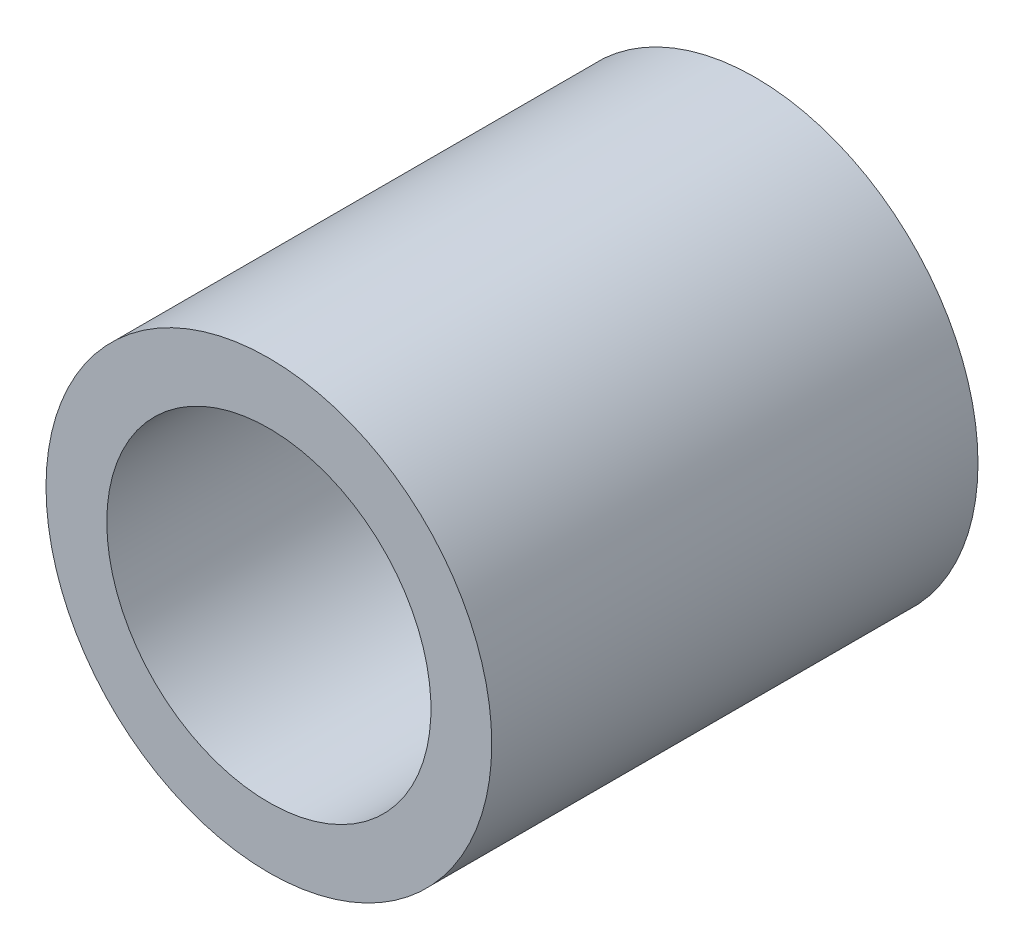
ISO-10303-21;
HEADER;
FILE_DESCRIPTION(('STEP AP214'),'2;1');
FILE_NAME('part.step','',(''),(''),'','','');
FILE_SCHEMA(('AUTOMOTIVE_DESIGN { 1 0 10303 214 1 1 1 1 }'));
ENDSEC;
DATA;
#1=APPLICATION_CONTEXT('core data for automotive mechanical design processes');
#2=APPLICATION_PROTOCOL_DEFINITION('international standard','automotive_design',2000,#1);
#3=PRODUCT_CONTEXT('',#1,'mechanical');
#4=PRODUCT('Part','Part','',(#3));
#5=PRODUCT_RELATED_PRODUCT_CATEGORY('part','',(#4));
#6=PRODUCT_DEFINITION_FORMATION('','',#4);
#7=PRODUCT_DEFINITION_CONTEXT('part definition',#1,'design');
#8=PRODUCT_DEFINITION('design','',#6,#7);
#9=PRODUCT_DEFINITION_SHAPE('','',#8);
#10=(LENGTH_UNIT() NAMED_UNIT(*) SI_UNIT(.MILLI.,.METRE.));
#11=(NAMED_UNIT(*) PLANE_ANGLE_UNIT() SI_UNIT($,.RADIAN.));
#12=(NAMED_UNIT(*) SI_UNIT($,.STERADIAN.) SOLID_ANGLE_UNIT());
#13=UNCERTAINTY_MEASURE_WITH_UNIT(LENGTH_MEASURE(1.E-05),#10,'distance_accuracy_value','');
#14=(GEOMETRIC_REPRESENTATION_CONTEXT(3) GLOBAL_UNCERTAINTY_ASSIGNED_CONTEXT((#13)) GLOBAL_UNIT_ASSIGNED_CONTEXT((#10,
#11,#12)) REPRESENTATION_CONTEXT('',''));
#15=CARTESIAN_POINT('',(0.,0.,0.));
#16=DIRECTION('',(0.,0.,1.));
#17=DIRECTION('',(1.,0.,0.));
#18=AXIS2_PLACEMENT_3D('',#15,#16,#17);
#19=CARTESIAN_POINT('',(0.,0.,19.05));
#20=DIRECTION('',(0.,0.,1.));
#21=DIRECTION('',(1.,0.,0.));
#22=AXIS2_PLACEMENT_3D('',#19,#20,#21);
#23=PLANE('',#22);
#24=CARTESIAN_POINT('',(0.,0.,19.05));
#25=DIRECTION('',(0.,0.,1.));
#26=DIRECTION('',(1.,0.,0.));
#27=AXIS2_PLACEMENT_3D('',#24,#25,#26);
#28=CIRCLE('',#27,8.73125);
#29=CARTESIAN_POINT('',(-8.73125,0.,19.05));
#30=VERTEX_POINT('',#29);
#31=EDGE_CURVE('E10',#30,#30,#28,.T.);
#32=ORIENTED_EDGE('',*,*,#31,.T.);
#33=EDGE_LOOP('',(#32));
#34=FACE_BOUND('',#33,.T.);
#35=CARTESIAN_POINT('',(0.,0.,19.05));
#36=DIRECTION('',(0.,0.,1.));
#37=DIRECTION('',(1.,0.,0.));
#38=AXIS2_PLACEMENT_3D('',#35,#36,#37);
#39=CIRCLE('',#38,6.35);
#40=CARTESIAN_POINT('',(-6.35,0.,19.05));
#41=VERTEX_POINT('',#40);
#42=EDGE_CURVE('E40',#41,#41,#39,.T.);
#43=ORIENTED_EDGE('',*,*,#42,.F.);
#44=EDGE_LOOP('',(#43));
#45=FACE_BOUND('',#44,.T.);
#46=ADVANCED_FACE('F29',(#34,#45),#23,.T.);
#47=CARTESIAN_POINT('',(0.,0.,0.));
#48=DIRECTION('',(0.,0.,1.));
#49=DIRECTION('',(1.,0.,0.));
#50=AXIS2_PLACEMENT_3D('',#47,#48,#49);
#51=PLANE('',#50);
#52=CARTESIAN_POINT('',(0.,0.,0.));
#53=DIRECTION('',(0.,0.,1.));
#54=DIRECTION('',(1.,0.,0.));
#55=AXIS2_PLACEMENT_3D('',#52,#53,#54);
#56=CIRCLE('',#55,8.73125);
#57=CARTESIAN_POINT('',(-8.73125,0.,0.));
#58=VERTEX_POINT('',#57);
#59=EDGE_CURVE('E36',#58,#58,#56,.T.);
#60=ORIENTED_EDGE('',*,*,#59,.F.);
#61=EDGE_LOOP('',(#60));
#62=FACE_BOUND('',#61,.T.);
#63=CARTESIAN_POINT('',(0.,0.,0.));
#64=DIRECTION('',(0.,0.,1.));
#65=DIRECTION('',(1.,0.,0.));
#66=AXIS2_PLACEMENT_3D('',#63,#64,#65);
#67=CIRCLE('',#66,6.35);
#68=CARTESIAN_POINT('',(-6.35,0.,0.));
#69=VERTEX_POINT('',#68);
#70=EDGE_CURVE('E44',#69,#69,#67,.T.);
#71=ORIENTED_EDGE('',*,*,#70,.T.);
#72=EDGE_LOOP('',(#71));
#73=FACE_BOUND('',#72,.T.);
#74=ADVANCED_FACE('F50',(#62,#73),#51,.F.);
#75=CARTESIAN_POINT('',(0.,0.,19.05));
#76=DIRECTION('',(0.,0.,-1.));
#77=DIRECTION('',(-1.,0.,0.));
#78=AXIS2_PLACEMENT_3D('',#75,#76,#77);
#79=CYLINDRICAL_SURFACE('',#78,8.73125);
#80=CARTESIAN_POINT('',(-8.73125,0.,19.05));
#81=CARTESIAN_POINT('',(-8.73125,0.,18.8515625));
#82=CARTESIAN_POINT('',(-8.73125,0.,18.653125));
#83=CARTESIAN_POINT('',(-8.73125,0.,18.25625));
#84=CARTESIAN_POINT('',(-8.73125,0.,18.0578125));
#85=CARTESIAN_POINT('',(-8.73125,0.,17.6609375));
#86=CARTESIAN_POINT('',(-8.73125,0.,17.4625));
#87=CARTESIAN_POINT('',(-8.73125,0.,17.065625));
#88=CARTESIAN_POINT('',(-8.73125,0.,16.8671875));
#89=CARTESIAN_POINT('',(-8.73125,0.,16.4703125));
#90=CARTESIAN_POINT('',(-8.73125,0.,16.271875));
#91=CARTESIAN_POINT('',(-8.73125,0.,15.875));
#92=CARTESIAN_POINT('',(-8.73125,0.,15.6765625));
#93=CARTESIAN_POINT('',(-8.73125,0.,15.2796875));
#94=CARTESIAN_POINT('',(-8.73125,0.,15.08125));
#95=CARTESIAN_POINT('',(-8.73125,0.,14.684375));
#96=CARTESIAN_POINT('',(-8.73125,0.,14.4859375));
#97=CARTESIAN_POINT('',(-8.73125,0.,14.0890625));
#98=CARTESIAN_POINT('',(-8.73125,0.,13.890625));
#99=CARTESIAN_POINT('',(-8.73125,0.,13.49375));
#100=CARTESIAN_POINT('',(-8.73125,0.,13.2953125));
#101=CARTESIAN_POINT('',(-8.73125,0.,12.8984375));
#102=CARTESIAN_POINT('',(-8.73125,0.,12.7));
#103=CARTESIAN_POINT('',(-8.73125,0.,12.303125));
#104=CARTESIAN_POINT('',(-8.73125,0.,12.1046875));
#105=CARTESIAN_POINT('',(-8.73125,0.,11.7078125));
#106=CARTESIAN_POINT('',(-8.73125,0.,11.509375));
#107=CARTESIAN_POINT('',(-8.73125,0.,11.1125));
#108=CARTESIAN_POINT('',(-8.73125,0.,10.9140625));
#109=CARTESIAN_POINT('',(-8.73125,0.,10.5171875));
#110=CARTESIAN_POINT('',(-8.73125,0.,10.31875));
#111=CARTESIAN_POINT('',(-8.73125,0.,9.921875));
#112=CARTESIAN_POINT('',(-8.73125,0.,9.7234375));
#113=CARTESIAN_POINT('',(-8.73125,0.,9.3265625));
#114=CARTESIAN_POINT('',(-8.73125,0.,9.128125));
#115=CARTESIAN_POINT('',(-8.73125,0.,8.73125));
#116=CARTESIAN_POINT('',(-8.73125,0.,8.5328125));
#117=CARTESIAN_POINT('',(-8.73125,0.,8.1359375));
#118=CARTESIAN_POINT('',(-8.73125,0.,7.9375));
#119=CARTESIAN_POINT('',(-8.73125,0.,7.540625));
#120=CARTESIAN_POINT('',(-8.73125,0.,7.3421875));
#121=CARTESIAN_POINT('',(-8.73125,0.,6.9453125));
#122=CARTESIAN_POINT('',(-8.73125,0.,6.746875));
#123=CARTESIAN_POINT('',(-8.73125,0.,6.35));
#124=CARTESIAN_POINT('',(-8.73125,0.,6.1515625));
#125=CARTESIAN_POINT('',(-8.73125,0.,5.7546875));
#126=CARTESIAN_POINT('',(-8.73125,0.,5.55625));
#127=CARTESIAN_POINT('',(-8.73125,0.,5.159375));
#128=CARTESIAN_POINT('',(-8.73125,0.,4.9609375));
#129=CARTESIAN_POINT('',(-8.73125,0.,4.5640625));
#130=CARTESIAN_POINT('',(-8.73125,0.,4.365625));
#131=CARTESIAN_POINT('',(-8.73125,0.,3.96875));
#132=CARTESIAN_POINT('',(-8.73125,0.,3.7703125));
#133=CARTESIAN_POINT('',(-8.73125,0.,3.3734375));
#134=CARTESIAN_POINT('',(-8.73125,0.,3.175));
#135=CARTESIAN_POINT('',(-8.73125,0.,2.778125));
#136=CARTESIAN_POINT('',(-8.73125,0.,2.5796875));
#137=CARTESIAN_POINT('',(-8.73125,0.,2.1828125));
#138=CARTESIAN_POINT('',(-8.73125,0.,1.984375));
#139=CARTESIAN_POINT('',(-8.73125,0.,1.5875));
#140=CARTESIAN_POINT('',(-8.73125,0.,1.3890625));
#141=CARTESIAN_POINT('',(-8.73125,0.,0.992187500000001));
#142=CARTESIAN_POINT('',(-8.73125,0.,0.793750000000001));
#143=CARTESIAN_POINT('',(-8.73125,0.,0.396875));
#144=CARTESIAN_POINT('',(-8.73125,0.,0.1984375));
#145=CARTESIAN_POINT('',(-8.73125,0.,0.));
#146=B_SPLINE_CURVE_WITH_KNOTS('',3,(#80,#81,#82,#83,#84,#85,#86,#87,#88,#89,#90,#91,#92,#93,
#94,#95,#96,#97,#98,#99,#100,#101,#102,#103,#104,#105,#106,#107,#108,#109,#110,#111,#112,#113,
#114,#115,#116,#117,#118,#119,#120,#121,#122,#123,#124,#125,#126,#127,#128,#129,#130,#131,#132,
#133,#134,#135,#136,#137,#138,#139,#140,#141,#142,#143,#144,#145),.UNSPECIFIED.,.F.,.F.,(4,2,2,
2,2,2,2,2,2,2,2,2,2,2,2,2,2,2,2,2,2,2,2,2,2,2,2,2,2,2,2,2,4),(0.,0.595312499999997,1.190625,
1.7859375,2.38125,2.9765625,3.571875,4.1671875,4.7625,5.3578125,5.953125,6.5484375,7.14375,
7.7390625,8.334375,8.9296875,9.525,10.1203125,10.715625,11.3109375,11.90625,12.5015625,
13.096875,13.6921875,14.2875,14.8828125,15.478125,16.0734375,16.66875,17.2640625,17.859375,
18.4546875,19.05),.UNSPECIFIED.);
#147=EDGE_CURVE('BSEAM31',#30,#58,#146,.T.);
#148=ORIENTED_EDGE('',*,*,#31,.F.);
#149=ORIENTED_EDGE('',*,*,#59,.T.);
#150=ORIENTED_EDGE('',*,*,#147,.T.);
#151=ORIENTED_EDGE('',*,*,#147,.F.);
#152=EDGE_LOOP('',(#148,#150,#149,#151));
#153=FACE_BOUND('',#152,.T.);
#154=ADVANCED_FACE('F31',(#153),#79,.T.);
#155=CARTESIAN_POINT('',(0.,0.,19.05));
#156=DIRECTION('',(0.,0.,-1.));
#157=DIRECTION('',(-1.,0.,0.));
#158=AXIS2_PLACEMENT_3D('',#155,#156,#157);
#159=CYLINDRICAL_SURFACE('',#158,6.35);
#160=CARTESIAN_POINT('',(-6.35,0.,19.05));
#161=CARTESIAN_POINT('',(-6.35,0.,18.8515625));
#162=CARTESIAN_POINT('',(-6.35,0.,18.653125));
#163=CARTESIAN_POINT('',(-6.35,0.,18.25625));
#164=CARTESIAN_POINT('',(-6.35,0.,18.0578125));
#165=CARTESIAN_POINT('',(-6.35,0.,17.6609375));
#166=CARTESIAN_POINT('',(-6.35,0.,17.4625));
#167=CARTESIAN_POINT('',(-6.35,0.,17.065625));
#168=CARTESIAN_POINT('',(-6.35,0.,16.8671875));
#169=CARTESIAN_POINT('',(-6.35,0.,16.4703125));
#170=CARTESIAN_POINT('',(-6.35,0.,16.271875));
#171=CARTESIAN_POINT('',(-6.35,0.,15.875));
#172=CARTESIAN_POINT('',(-6.35,0.,15.6765625));
#173=CARTESIAN_POINT('',(-6.35,0.,15.2796875));
#174=CARTESIAN_POINT('',(-6.35,0.,15.08125));
#175=CARTESIAN_POINT('',(-6.35,0.,14.684375));
#176=CARTESIAN_POINT('',(-6.35,0.,14.4859375));
#177=CARTESIAN_POINT('',(-6.35,0.,14.0890625));
#178=CARTESIAN_POINT('',(-6.35,0.,13.890625));
#179=CARTESIAN_POINT('',(-6.35,0.,13.49375));
#180=CARTESIAN_POINT('',(-6.35,0.,13.2953125));
#181=CARTESIAN_POINT('',(-6.35,0.,12.8984375));
#182=CARTESIAN_POINT('',(-6.35,0.,12.7));
#183=CARTESIAN_POINT('',(-6.35,0.,12.303125));
#184=CARTESIAN_POINT('',(-6.35,0.,12.1046875));
#185=CARTESIAN_POINT('',(-6.35,0.,11.7078125));
#186=CARTESIAN_POINT('',(-6.35,0.,11.509375));
#187=CARTESIAN_POINT('',(-6.35,0.,11.1125));
#188=CARTESIAN_POINT('',(-6.35,0.,10.9140625));
#189=CARTESIAN_POINT('',(-6.35,0.,10.5171875));
#190=CARTESIAN_POINT('',(-6.35,0.,10.31875));
#191=CARTESIAN_POINT('',(-6.35,0.,9.921875));
#192=CARTESIAN_POINT('',(-6.35,0.,9.7234375));
#193=CARTESIAN_POINT('',(-6.35,0.,9.3265625));
#194=CARTESIAN_POINT('',(-6.35,0.,9.128125));
#195=CARTESIAN_POINT('',(-6.35,0.,8.73125));
#196=CARTESIAN_POINT('',(-6.35,0.,8.5328125));
#197=CARTESIAN_POINT('',(-6.35,0.,8.1359375));
#198=CARTESIAN_POINT('',(-6.35,0.,7.9375));
#199=CARTESIAN_POINT('',(-6.35,0.,7.540625));
#200=CARTESIAN_POINT('',(-6.35,0.,7.3421875));
#201=CARTESIAN_POINT('',(-6.35,0.,6.9453125));
#202=CARTESIAN_POINT('',(-6.35,0.,6.746875));
#203=CARTESIAN_POINT('',(-6.35,0.,6.35));
#204=CARTESIAN_POINT('',(-6.35,0.,6.1515625));
#205=CARTESIAN_POINT('',(-6.35,0.,5.7546875));
#206=CARTESIAN_POINT('',(-6.35,0.,5.55625));
#207=CARTESIAN_POINT('',(-6.35,0.,5.159375));
#208=CARTESIAN_POINT('',(-6.35,0.,4.9609375));
#209=CARTESIAN_POINT('',(-6.35,0.,4.5640625));
#210=CARTESIAN_POINT('',(-6.35,0.,4.365625));
#211=CARTESIAN_POINT('',(-6.35,0.,3.96875));
#212=CARTESIAN_POINT('',(-6.35,0.,3.7703125));
#213=CARTESIAN_POINT('',(-6.35,0.,3.3734375));
#214=CARTESIAN_POINT('',(-6.35,0.,3.175));
#215=CARTESIAN_POINT('',(-6.35,0.,2.778125));
#216=CARTESIAN_POINT('',(-6.35,0.,2.5796875));
#217=CARTESIAN_POINT('',(-6.35,0.,2.1828125));
#218=CARTESIAN_POINT('',(-6.35,0.,1.984375));
#219=CARTESIAN_POINT('',(-6.35,0.,1.5875));
#220=CARTESIAN_POINT('',(-6.35,0.,1.3890625));
#221=CARTESIAN_POINT('',(-6.35,0.,0.992187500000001));
#222=CARTESIAN_POINT('',(-6.35,0.,0.793750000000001));
#223=CARTESIAN_POINT('',(-6.35,0.,0.396875));
#224=CARTESIAN_POINT('',(-6.35,0.,0.1984375));
#225=CARTESIAN_POINT('',(-6.35,0.,0.));
#226=B_SPLINE_CURVE_WITH_KNOTS('',3,(#160,#161,#162,#163,#164,#165,#166,#167,#168,#169,#170,
#171,#172,#173,#174,#175,#176,#177,#178,#179,#180,#181,#182,#183,#184,#185,#186,#187,#188,#189,
#190,#191,#192,#193,#194,#195,#196,#197,#198,#199,#200,#201,#202,#203,#204,#205,#206,#207,#208,
#209,#210,#211,#212,#213,#214,#215,#216,#217,#218,#219,#220,#221,#222,#223,#224,#225),
.UNSPECIFIED.,.F.,.F.,(4,2,2,2,2,2,2,2,2,2,2,2,2,2,2,2,2,2,2,2,2,2,2,2,2,2,2,2,2,2,2,2,4),(0.,
0.5953125,1.190625,1.7859375,2.38125,2.9765625,3.571875,4.1671875,4.7625,5.3578125,5.953125,
6.5484375,7.14375,7.7390625,8.334375,8.9296875,9.525,10.1203125,10.715625,11.3109375,11.90625,
12.5015625,13.096875,13.6921875,14.2875,14.8828125,15.478125,16.0734375,16.66875,17.2640625,
17.859375,18.4546875,19.05),.UNSPECIFIED.);
#227=EDGE_CURVE('BSEAM52',#41,#69,#226,.T.);
#228=ORIENTED_EDGE('',*,*,#42,.T.);
#229=ORIENTED_EDGE('',*,*,#70,.F.);
#230=ORIENTED_EDGE('',*,*,#227,.T.);
#231=ORIENTED_EDGE('',*,*,#227,.F.);
#232=EDGE_LOOP('',(#228,#230,#229,#231));
#233=FACE_BOUND('',#232,.T.);
#234=ADVANCED_FACE('F52',(#233),#159,.F.);
#235=CLOSED_SHELL('',(#46,#74,#154,#234));
#236=MANIFOLD_SOLID_BREP('B2',#235);
#237=ADVANCED_BREP_SHAPE_REPRESENTATION('',(#18,#236),#14);
#238=SHAPE_DEFINITION_REPRESENTATION(#9,#237);
ENDSEC;
END-ISO-10303-21;
